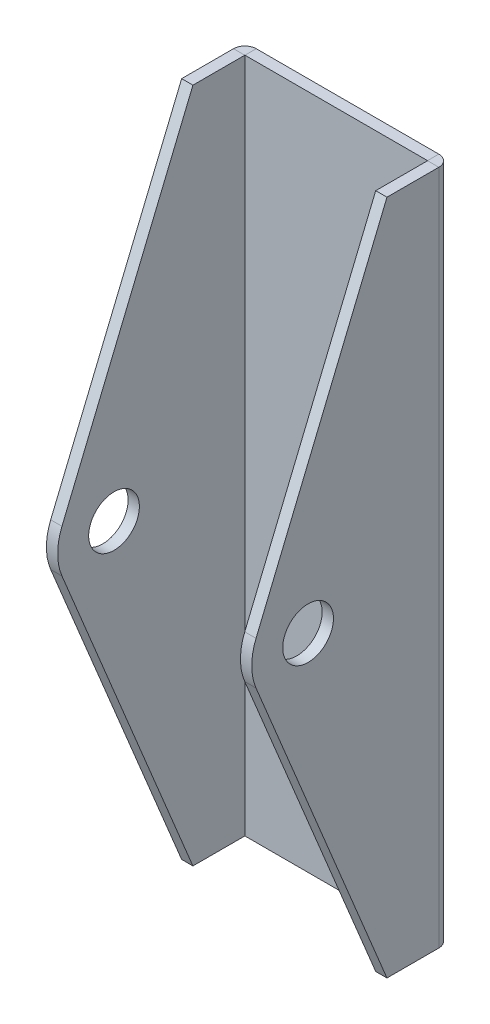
ISO-10303-21;
HEADER;
FILE_DESCRIPTION(('STEP AP214'),'2;1');
FILE_NAME('part.step','',(''),(''),'','','');
FILE_SCHEMA(('AUTOMOTIVE_DESIGN { 1 0 10303 214 1 1 1 1 }'));
ENDSEC;
DATA;
#1=APPLICATION_CONTEXT('core data for automotive mechanical design processes');
#2=APPLICATION_PROTOCOL_DEFINITION('international standard','automotive_design',2000,#1);
#3=PRODUCT_CONTEXT('',#1,'mechanical');
#4=PRODUCT('Part','Part','',(#3));
#5=PRODUCT_RELATED_PRODUCT_CATEGORY('part','',(#4));
#6=PRODUCT_DEFINITION_FORMATION('','',#4);
#7=PRODUCT_DEFINITION_CONTEXT('part definition',#1,'design');
#8=PRODUCT_DEFINITION('design','',#6,#7);
#9=PRODUCT_DEFINITION_SHAPE('','',#8);
#10=(LENGTH_UNIT() NAMED_UNIT(*) SI_UNIT(.MILLI.,.METRE.));
#11=(NAMED_UNIT(*) PLANE_ANGLE_UNIT() SI_UNIT($,.RADIAN.));
#12=(NAMED_UNIT(*) SI_UNIT($,.STERADIAN.) SOLID_ANGLE_UNIT());
#13=UNCERTAINTY_MEASURE_WITH_UNIT(LENGTH_MEASURE(1.E-05),#10,'distance_accuracy_value','');
#14=(GEOMETRIC_REPRESENTATION_CONTEXT(3) GLOBAL_UNCERTAINTY_ASSIGNED_CONTEXT((#13)) GLOBAL_UNIT_ASSIGNED_CONTEXT((#10,
#11,#12)) REPRESENTATION_CONTEXT('',''));
#15=CARTESIAN_POINT('',(0.,0.,0.));
#16=DIRECTION('',(0.,0.,1.));
#17=DIRECTION('',(1.,0.,0.));
#18=AXIS2_PLACEMENT_3D('',#15,#16,#17);
#19=CARTESIAN_POINT('',(-19.3993197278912,0.,1.));
#20=DIRECTION('',(0.,0.,1.));
#21=DIRECTION('',(1.,0.,0.));
#22=AXIS2_PLACEMENT_3D('',#19,#20,#21);
#23=PLANE('',#22);
#24=CARTESIAN_POINT('',(1.10068027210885,0.,1.));
#25=DIRECTION('',(0.,0.,1.));
#26=DIRECTION('',(1.,0.,0.));
#27=AXIS2_PLACEMENT_3D('',#24,#25,#26);
#28=CIRCLE('',#27,2.75);
#29=CARTESIAN_POINT('',(3.85068027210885,0.,1.));
#30=VERTEX_POINT('',#29);
#31=EDGE_CURVE('E280',#30,#30,#28,.T.);
#32=ORIENTED_EDGE('',*,*,#31,.F.);
#33=EDGE_LOOP('',(#32));
#34=FACE_BOUND('',#33,.T.);
#35=DIRECTION('',(1.,0.,0.));
#36=VECTOR('',#35,1.);
#37=CARTESIAN_POINT('',(-12.3998798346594,-30.0002317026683,1.));
#38=LINE('',#37,#36);
#39=CARTESIAN_POINT('',(-6.99876666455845,-30.0002317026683,0.999999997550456));
#40=VERTEX_POINT('',#39);
#41=CARTESIAN_POINT('',(9.20012720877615,-30.0002317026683,1.));
#42=VERTEX_POINT('',#41);
#43=EDGE_CURVE('E44',#40,#42,#38,.T.);
#44=ORIENTED_EDGE('',*,*,#43,.T.);
#45=DIRECTION('',(0.,1.,0.));
#46=VECTOR('',#45,1.);
#47=CARTESIAN_POINT('',(9.20012720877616,0.,1.));
#48=LINE('',#47,#46);
#49=CARTESIAN_POINT('',(9.20012720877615,30.0002317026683,0.999999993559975));
#50=VERTEX_POINT('',#49);
#51=EDGE_CURVE('E293',#42,#50,#48,.T.);
#52=ORIENTED_EDGE('',*,*,#51,.T.);
#53=DIRECTION('',(-1.,0.,0.));
#54=VECTOR('',#53,1.);
#55=CARTESIAN_POINT('',(-12.3998798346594,30.0002317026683,1.));
#56=LINE('',#55,#54);
#57=CARTESIAN_POINT('',(-6.99876666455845,30.0002317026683,0.999999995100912));
#58=VERTEX_POINT('',#57);
#59=EDGE_CURVE('E286',#50,#58,#56,.T.);
#60=ORIENTED_EDGE('',*,*,#59,.T.);
#61=DIRECTION('',(0.,1.,0.));
#62=VECTOR('',#61,1.);
#63=CARTESIAN_POINT('',(-6.99876666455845,0.,1.));
#64=LINE('',#63,#62);
#65=EDGE_CURVE('E283',#40,#58,#64,.T.);
#66=ORIENTED_EDGE('',*,*,#65,.F.);
#67=EDGE_LOOP('',(#44,#52,#60,#66));
#68=FACE_BOUND('',#67,.T.);
#69=ADVANCED_FACE('F40',(#34,#68),#23,.T.);
#70=CARTESIAN_POINT('',(-12.3998798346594,30.0002317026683,1.));
#71=DIRECTION('',(0.,-1.,0.));
#72=DIRECTION('',(1.,0.,0.));
#73=AXIS2_PLACEMENT_3D('',#70,#71,#72);
#74=PLANE('',#73);
#75=DIRECTION('',(0.,0.,1.));
#76=VECTOR('',#75,1.);
#77=CARTESIAN_POINT('',(9.20012720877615,30.0002317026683,1.));
#78=LINE('',#77,#76);
#79=CARTESIAN_POINT('',(9.20012720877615,30.0002317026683,0.));
#80=VERTEX_POINT('',#79);
#81=EDGE_CURVE('E12',#80,#50,#78,.T.);
#82=ORIENTED_EDGE('',*,*,#81,.F.);
#83=DIRECTION('',(-1.,0.,0.));
#84=VECTOR('',#83,1.);
#85=CARTESIAN_POINT('',(-12.3998798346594,30.0002317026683,0.));
#86=LINE('',#85,#84);
#87=CARTESIAN_POINT('',(-6.99876666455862,30.0002317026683,-4.89908807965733E-09));
#88=VERTEX_POINT('',#87);
#89=EDGE_CURVE('E57',#80,#88,#86,.T.);
#90=ORIENTED_EDGE('',*,*,#89,.T.);
#91=DIRECTION('',(0.,0.,1.));
#92=VECTOR('',#91,1.);
#93=CARTESIAN_POINT('',(-6.99876666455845,30.0002317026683,1.));
#94=LINE('',#93,#92);
#95=EDGE_CURVE('E285',#88,#58,#94,.T.);
#96=ORIENTED_EDGE('',*,*,#95,.T.);
#97=ORIENTED_EDGE('',*,*,#59,.F.);
#98=EDGE_LOOP('',(#82,#90,#96,#97));
#99=FACE_BOUND('',#98,.T.);
#100=ADVANCED_FACE('F42',(#99),#74,.F.);
#101=CARTESIAN_POINT('',(-12.3998798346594,-30.0002317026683,1.));
#102=DIRECTION('',(0.,1.,0.));
#103=DIRECTION('',(0.,0.,1.));
#104=AXIS2_PLACEMENT_3D('',#101,#102,#103);
#105=PLANE('',#104);
#106=DIRECTION('',(0.,0.,-1.));
#107=VECTOR('',#106,1.);
#108=CARTESIAN_POINT('',(9.20012720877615,-30.0002317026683,1.));
#109=LINE('',#108,#107);
#110=CARTESIAN_POINT('',(9.20012720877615,-30.0002317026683,0.));
#111=VERTEX_POINT('',#110);
#112=EDGE_CURVE('E296',#42,#111,#109,.T.);
#113=ORIENTED_EDGE('',*,*,#112,.F.);
#114=ORIENTED_EDGE('',*,*,#43,.F.);
#115=DIRECTION('',(0.,0.,-1.));
#116=VECTOR('',#115,1.);
#117=CARTESIAN_POINT('',(-6.99876666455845,-30.0002317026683,1.));
#118=LINE('',#117,#116);
#119=CARTESIAN_POINT('',(-6.99876666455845,-30.0002317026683,0.));
#120=VERTEX_POINT('',#119);
#121=EDGE_CURVE('E291',#40,#120,#118,.T.);
#122=ORIENTED_EDGE('',*,*,#121,.T.);
#123=DIRECTION('',(1.,0.,0.));
#124=VECTOR('',#123,1.);
#125=CARTESIAN_POINT('',(-12.3998798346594,-30.0002317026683,0.));
#126=LINE('',#125,#124);
#127=EDGE_CURVE('E65',#120,#111,#126,.T.);
#128=ORIENTED_EDGE('',*,*,#127,.T.);
#129=EDGE_LOOP('',(#113,#114,#122,#128));
#130=FACE_BOUND('',#129,.T.);
#131=ADVANCED_FACE('F307',(#130),#105,.F.);
#132=CARTESIAN_POINT('',(-19.3993197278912,0.,0.));
#133=DIRECTION('',(0.,0.,1.));
#134=DIRECTION('',(1.,0.,0.));
#135=AXIS2_PLACEMENT_3D('',#132,#133,#134);
#136=PLANE('',#135);
#137=DIRECTION('',(0.,1.,0.));
#138=VECTOR('',#137,1.);
#139=CARTESIAN_POINT('',(9.20012720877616,0.,0.));
#140=LINE('',#139,#138);
#141=EDGE_CURVE('E49',#111,#80,#140,.T.);
#142=ORIENTED_EDGE('',*,*,#141,.F.);
#143=ORIENTED_EDGE('',*,*,#127,.F.);
#144=DIRECTION('',(0.,1.,0.));
#145=VECTOR('',#144,1.);
#146=CARTESIAN_POINT('',(-6.99876666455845,0.,0.));
#147=LINE('',#146,#145);
#148=EDGE_CURVE('E289',#120,#88,#147,.T.);
#149=ORIENTED_EDGE('',*,*,#148,.T.);
#150=ORIENTED_EDGE('',*,*,#89,.F.);
#151=EDGE_LOOP('',(#142,#143,#149,#150));
#152=FACE_BOUND('',#151,.T.);
#153=CARTESIAN_POINT('',(1.10068027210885,0.,0.));
#154=DIRECTION('',(0.,0.,1.));
#155=DIRECTION('',(1.,0.,0.));
#156=AXIS2_PLACEMENT_3D('',#153,#154,#155);
#157=CIRCLE('',#156,2.75);
#158=CARTESIAN_POINT('',(3.85068027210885,0.,0.));
#159=VERTEX_POINT('',#158);
#160=EDGE_CURVE('E277',#159,#159,#157,.T.);
#161=ORIENTED_EDGE('',*,*,#160,.T.);
#162=EDGE_LOOP('',(#161));
#163=FACE_BOUND('',#162,.T.);
#164=ADVANCED_FACE('F337',(#152,#163),#136,.F.);
#165=CARTESIAN_POINT('',(1.10068027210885,0.,1.));
#166=DIRECTION('',(0.,0.,-1.));
#167=DIRECTION('',(-1.,0.,0.));
#168=AXIS2_PLACEMENT_3D('',#165,#166,#167);
#169=CYLINDRICAL_SURFACE('',#168,2.75);
#170=ORIENTED_EDGE('',*,*,#31,.T.);
#171=EDGE_LOOP('',(#170));
#172=FACE_BOUND('',#171,.T.);
#173=ORIENTED_EDGE('',*,*,#160,.F.);
#174=EDGE_LOOP('',(#173));
#175=FACE_BOUND('',#174,.T.);
#176=ADVANCED_FACE('F400',(#172,#175),#169,.F.);
#177=CARTESIAN_POINT('',(-6.99876666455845,-30.0002317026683,1.01000000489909));
#178=DIRECTION('',(0.,1.,0.));
#179=DIRECTION('',(0.,0.,1.));
#180=AXIS2_PLACEMENT_3D('',#177,#178,#179);
#181=PLANE('',#180);
#182=DIRECTION('',(-1.,0.,0.));
#183=VECTOR('',#182,1.);
#184=CARTESIAN_POINT('',(-7.00876666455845,-30.0002317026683,1.01));
#185=LINE('',#184,#183);
#186=CARTESIAN_POINT('',(-7.00876666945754,-30.0002317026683,1.01));
#187=VERTEX_POINT('',#186);
#188=CARTESIAN_POINT('',(-8.00876666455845,-30.0002317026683,1.01));
#189=VERTEX_POINT('',#188);
#190=EDGE_CURVE('E214',#187,#189,#185,.T.);
#191=ORIENTED_EDGE('',*,*,#190,.T.);
#192=CARTESIAN_POINT('',(-6.99876666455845,-30.0002317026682,1.01));
#193=DIRECTION('',(0.,-1.,0.));
#194=DIRECTION('',(0.,0.,-1.));
#195=AXIS2_PLACEMENT_3D('',#192,#193,#194);
#196=CIRCLE('',#195,1.01000000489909);
#197=EDGE_CURVE('E217',#189,#120,#196,.T.);
#198=ORIENTED_EDGE('',*,*,#197,.T.);
#199=ORIENTED_EDGE('',*,*,#121,.F.);
#200=CARTESIAN_POINT('',(-6.99876666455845,-30.0002317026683,1.01000000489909));
#201=DIRECTION('',(0.,-1.,0.));
#202=DIRECTION('',(0.,0.,-1.));
#203=AXIS2_PLACEMENT_3D('',#200,#201,#202);
#204=CIRCLE('',#203,0.0100000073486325);
#205=EDGE_CURVE('E271',#187,#40,#204,.T.);
#206=ORIENTED_EDGE('',*,*,#205,.F.);
#207=EDGE_LOOP('',(#191,#198,#199,#206));
#208=FACE_BOUND('',#207,.T.);
#209=ADVANCED_FACE('F342',(#208),#181,.F.);
#210=CARTESIAN_POINT('',(-6.99876666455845,30.0002317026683,1.01000000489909));
#211=DIRECTION('',(0.,-1.,0.));
#212=DIRECTION('',(0.,0.,-1.));
#213=AXIS2_PLACEMENT_3D('',#210,#211,#212);
#214=PLANE('',#213);
#215=CARTESIAN_POINT('',(-6.99876666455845,30.0002317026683,1.01));
#216=DIRECTION('',(0.,-1.,0.));
#217=DIRECTION('',(0.,0.,-1.));
#218=AXIS2_PLACEMENT_3D('',#215,#216,#217);
#219=CIRCLE('',#218,1.01000000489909);
#220=CARTESIAN_POINT('',(-8.00876666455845,30.0002317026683,1.01));
#221=VERTEX_POINT('',#220);
#222=EDGE_CURVE('E268',#88,#221,#219,.F.);
#223=ORIENTED_EDGE('',*,*,#222,.T.);
#224=DIRECTION('',(1.,0.,0.));
#225=VECTOR('',#224,1.);
#226=CARTESIAN_POINT('',(-7.00876666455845,30.0002317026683,1.01));
#227=LINE('',#226,#225);
#228=CARTESIAN_POINT('',(-7.00876666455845,30.0002317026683,1.01));
#229=VERTEX_POINT('',#228);
#230=EDGE_CURVE('E259',#221,#229,#227,.T.);
#231=ORIENTED_EDGE('',*,*,#230,.T.);
#232=CARTESIAN_POINT('',(-6.99876666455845,30.0002317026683,1.01000000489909));
#233=DIRECTION('',(0.,1.,0.));
#234=DIRECTION('',(0.,0.,1.));
#235=AXIS2_PLACEMENT_3D('',#232,#233,#234);
#236=CIRCLE('',#235,0.0100000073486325);
#237=EDGE_CURVE('E274',#58,#229,#236,.T.);
#238=ORIENTED_EDGE('',*,*,#237,.F.);
#239=ORIENTED_EDGE('',*,*,#95,.F.);
#240=EDGE_LOOP('',(#223,#231,#238,#239));
#241=FACE_BOUND('',#240,.T.);
#242=ADVANCED_FACE('F358',(#241),#214,.F.);
#243=CARTESIAN_POINT('',(-6.99876666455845,60.0141431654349,1.01));
#244=DIRECTION('',(0.,-1.,0.));
#245=DIRECTION('',(0.,0.,-1.));
#246=AXIS2_PLACEMENT_3D('',#243,#244,#245);
#247=CYLINDRICAL_SURFACE('',#246,0.010000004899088);
#248=ORIENTED_EDGE('',*,*,#65,.T.);
#249=ORIENTED_EDGE('',*,*,#237,.T.);
#250=DIRECTION('',(0.,1.,0.));
#251=VECTOR('',#250,1.);
#252=CARTESIAN_POINT('',(-7.00876666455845,0.,1.01));
#253=LINE('',#252,#251);
#254=EDGE_CURVE('E235',#187,#229,#253,.T.);
#255=ORIENTED_EDGE('',*,*,#254,.F.);
#256=ORIENTED_EDGE('',*,*,#205,.T.);
#257=EDGE_LOOP('',(#248,#249,#255,#256));
#258=FACE_BOUND('',#257,.T.);
#259=ADVANCED_FACE('F346',(#258),#247,.F.);
#260=CARTESIAN_POINT('',(-6.99876666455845,60.0141431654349,1.01));
#261=DIRECTION('',(0.,-1.,0.));
#262=DIRECTION('',(0.,0.,-1.));
#263=AXIS2_PLACEMENT_3D('',#260,#261,#262);
#264=CYLINDRICAL_SURFACE('',#263,1.01000000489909);
#265=ORIENTED_EDGE('',*,*,#148,.F.);
#266=ORIENTED_EDGE('',*,*,#197,.F.);
#267=DIRECTION('',(0.,1.,0.));
#268=VECTOR('',#267,1.);
#269=CARTESIAN_POINT('',(-8.00876666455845,0.,1.01));
#270=LINE('',#269,#268);
#271=EDGE_CURVE('E262',#189,#221,#270,.T.);
#272=ORIENTED_EDGE('',*,*,#271,.T.);
#273=ORIENTED_EDGE('',*,*,#222,.F.);
#274=EDGE_LOOP('',(#265,#266,#272,#273));
#275=FACE_BOUND('',#274,.T.);
#276=ADVANCED_FACE('F361',(#275),#264,.T.);
#277=CARTESIAN_POINT('',(-7.00876666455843,-30.0002317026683,5.61000704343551));
#278=DIRECTION('',(0.,0.382259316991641,-0.92405509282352));
#279=DIRECTION('',(0.,0.92405509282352,0.382259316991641));
#280=AXIS2_PLACEMENT_3D('',#277,#278,#279);
#281=PLANE('',#280);
#282=DIRECTION('',(0.,-0.92405509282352,-0.382259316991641));
#283=VECTOR('',#282,1.);
#284=CARTESIAN_POINT('',(-8.00876666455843,-30.0002317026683,5.61000704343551));
#285=LINE('',#284,#283);
#286=CARTESIAN_POINT('',(-8.0087666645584,-1.9112965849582,17.2297224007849));
#287=VERTEX_POINT('',#286);
#288=CARTESIAN_POINT('',(-8.00876666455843,-30.0002317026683,5.61000704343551));
#289=VERTEX_POINT('',#288);
#290=EDGE_CURVE('E257',#287,#289,#285,.T.);
#291=ORIENTED_EDGE('',*,*,#290,.T.);
#292=DIRECTION('',(-1.,0.,0.));
#293=VECTOR('',#292,1.);
#294=CARTESIAN_POINT('',(-7.00876666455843,-30.0002317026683,5.61000704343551));
#295=LINE('',#294,#293);
#296=CARTESIAN_POINT('',(-7.00876666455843,-30.0002317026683,5.61000704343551));
#297=VERTEX_POINT('',#296);
#298=EDGE_CURVE('E218',#297,#289,#295,.T.);
#299=ORIENTED_EDGE('',*,*,#298,.F.);
#300=DIRECTION('',(0.,-0.92405509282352,-0.382259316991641));
#301=VECTOR('',#300,1.);
#302=CARTESIAN_POINT('',(-7.00876666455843,-30.0002317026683,5.61000704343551));
#303=LINE('',#302,#301);
#304=CARTESIAN_POINT('',(-7.00876666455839,-1.9112965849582,17.2297224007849));
#305=VERTEX_POINT('',#304);
#306=EDGE_CURVE('E226',#305,#297,#303,.T.);
#307=ORIENTED_EDGE('',*,*,#306,.F.);
#308=DIRECTION('',(-1.,0.,0.));
#309=VECTOR('',#308,1.);
#310=CARTESIAN_POINT('',(-7.00876666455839,-1.9112965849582,17.2297224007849));
#311=LINE('',#310,#309);
#312=EDGE_CURVE('E254',#305,#287,#311,.T.);
#313=ORIENTED_EDGE('',*,*,#312,.T.);
#314=EDGE_LOOP('',(#291,#299,#307,#313));
#315=FACE_BOUND('',#314,.T.);
#316=ADVANCED_FACE('F374',(#315),#281,.F.);
#317=CARTESIAN_POINT('',(-7.00876666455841,0.,12.6094469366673));
#318=DIRECTION('',(-1.,0.,0.));
#319=DIRECTION('',(0.,0.,1.));
#320=AXIS2_PLACEMENT_3D('',#317,#318,#319);
#321=CYLINDRICAL_SURFACE('',#320,5.);
#322=CARTESIAN_POINT('',(-8.00876666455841,0.,12.6094469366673));
#323=DIRECTION('',(1.,0.,0.));
#324=DIRECTION('',(0.,0.,-1.));
#325=AXIS2_PLACEMENT_3D('',#322,#323,#324);
#326=CIRCLE('',#325,5.);
#327=CARTESIAN_POINT('',(-8.0087666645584,1.9112965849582,17.2297224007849));
#328=VERTEX_POINT('',#327);
#329=EDGE_CURVE('E252',#328,#287,#326,.T.);
#330=ORIENTED_EDGE('',*,*,#329,.T.);
#331=ORIENTED_EDGE('',*,*,#312,.F.);
#332=CARTESIAN_POINT('',(-7.00876666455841,0.,12.6094469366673));
#333=DIRECTION('',(1.,0.,0.));
#334=DIRECTION('',(0.,0.,-1.));
#335=AXIS2_PLACEMENT_3D('',#332,#333,#334);
#336=CIRCLE('',#335,5.);
#337=CARTESIAN_POINT('',(-7.00876666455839,1.9112965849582,17.2297224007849));
#338=VERTEX_POINT('',#337);
#339=EDGE_CURVE('E228',#338,#305,#336,.T.);
#340=ORIENTED_EDGE('',*,*,#339,.F.);
#341=DIRECTION('',(-1.,0.,0.));
#342=VECTOR('',#341,1.);
#343=CARTESIAN_POINT('',(-7.00876666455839,1.9112965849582,17.2297224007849));
#344=LINE('',#343,#342);
#345=EDGE_CURVE('E249',#338,#328,#344,.T.);
#346=ORIENTED_EDGE('',*,*,#345,.T.);
#347=EDGE_LOOP('',(#330,#331,#340,#346));
#348=FACE_BOUND('',#347,.T.);
#349=ADVANCED_FACE('F378',(#348),#321,.T.);
#350=CARTESIAN_POINT('',(-7.00876666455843,30.0002317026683,5.61000704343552));
#351=DIRECTION('',(0.,-0.382259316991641,-0.92405509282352));
#352=DIRECTION('',(0.,0.92405509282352,-0.382259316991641));
#353=AXIS2_PLACEMENT_3D('',#350,#351,#352);
#354=PLANE('',#353);
#355=DIRECTION('',(0.,-0.92405509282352,0.382259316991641));
#356=VECTOR('',#355,1.);
#357=CARTESIAN_POINT('',(-8.00876666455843,30.0002317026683,5.61000704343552));
#358=LINE('',#357,#356);
#359=CARTESIAN_POINT('',(-8.00876666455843,30.0002317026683,5.61000704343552));
#360=VERTEX_POINT('',#359);
#361=EDGE_CURVE('E246',#360,#328,#358,.T.);
#362=ORIENTED_EDGE('',*,*,#361,.T.);
#363=ORIENTED_EDGE('',*,*,#345,.F.);
#364=DIRECTION('',(0.,-0.92405509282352,0.382259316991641));
#365=VECTOR('',#364,1.);
#366=CARTESIAN_POINT('',(-7.00876666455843,30.0002317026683,5.61000704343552));
#367=LINE('',#366,#365);
#368=CARTESIAN_POINT('',(-7.00876666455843,30.0002317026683,5.61000704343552));
#369=VERTEX_POINT('',#368);
#370=EDGE_CURVE('E230',#369,#338,#367,.T.);
#371=ORIENTED_EDGE('',*,*,#370,.F.);
#372=DIRECTION('',(-1.,0.,0.));
#373=VECTOR('',#372,1.);
#374=CARTESIAN_POINT('',(-7.00876666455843,30.0002317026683,5.61000704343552));
#375=LINE('',#374,#373);
#376=EDGE_CURVE('E243',#369,#360,#375,.T.);
#377=ORIENTED_EDGE('',*,*,#376,.T.);
#378=EDGE_LOOP('',(#362,#363,#371,#377));
#379=FACE_BOUND('',#378,.T.);
#380=ADVANCED_FACE('F380',(#379),#354,.F.);
#381=CARTESIAN_POINT('',(-7.00876666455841,0.,12.6094469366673));
#382=DIRECTION('',(-1.,0.,0.));
#383=DIRECTION('',(0.,0.,1.));
#384=AXIS2_PLACEMENT_3D('',#381,#382,#383);
#385=CYLINDRICAL_SURFACE('',#384,2.25);
#386=CARTESIAN_POINT('',(-7.00876666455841,0.,12.6094469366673));
#387=DIRECTION('',(1.,0.,0.));
#388=DIRECTION('',(0.,0.,-1.));
#389=AXIS2_PLACEMENT_3D('',#386,#387,#388);
#390=CIRCLE('',#389,2.25);
#391=CARTESIAN_POINT('',(-7.00876666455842,0.,10.3594469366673));
#392=VERTEX_POINT('',#391);
#393=EDGE_CURVE('E240',#392,#392,#390,.T.);
#394=ORIENTED_EDGE('',*,*,#393,.T.);
#395=EDGE_LOOP('',(#394));
#396=FACE_BOUND('',#395,.T.);
#397=CARTESIAN_POINT('',(-8.00876666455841,0.,12.6094469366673));
#398=DIRECTION('',(1.,0.,0.));
#399=DIRECTION('',(0.,0.,-1.));
#400=AXIS2_PLACEMENT_3D('',#397,#398,#399);
#401=CIRCLE('',#400,2.25);
#402=CARTESIAN_POINT('',(-8.00876666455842,0.,10.3594469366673));
#403=VERTEX_POINT('',#402);
#404=EDGE_CURVE('E221',#403,#403,#401,.T.);
#405=ORIENTED_EDGE('',*,*,#404,.F.);
#406=EDGE_LOOP('',(#405));
#407=FACE_BOUND('',#406,.T.);
#408=ADVANCED_FACE('F382',(#396,#407),#385,.F.);
#409=CARTESIAN_POINT('',(-7.00876666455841,0.,12.6094469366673));
#410=DIRECTION('',(1.,0.,0.));
#411=DIRECTION('',(0.,0.,-1.));
#412=AXIS2_PLACEMENT_3D('',#409,#410,#411);
#413=PLANE('',#412);
#414=ORIENTED_EDGE('',*,*,#393,.F.);
#415=EDGE_LOOP('',(#414));
#416=FACE_BOUND('',#415,.T.);
#417=DIRECTION('',(0.,0.,-1.));
#418=VECTOR('',#417,1.);
#419=CARTESIAN_POINT('',(-7.00876666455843,-30.0002317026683,5.61000704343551));
#420=LINE('',#419,#418);
#421=EDGE_CURVE('E237',#297,#187,#420,.T.);
#422=ORIENTED_EDGE('',*,*,#421,.T.);
#423=ORIENTED_EDGE('',*,*,#254,.T.);
#424=DIRECTION('',(0.,0.,1.));
#425=VECTOR('',#424,1.);
#426=CARTESIAN_POINT('',(-7.00876666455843,30.0002317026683,5.61000704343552));
#427=LINE('',#426,#425);
#428=EDGE_CURVE('E233',#229,#369,#427,.T.);
#429=ORIENTED_EDGE('',*,*,#428,.T.);
#430=ORIENTED_EDGE('',*,*,#370,.T.);
#431=ORIENTED_EDGE('',*,*,#339,.T.);
#432=ORIENTED_EDGE('',*,*,#306,.T.);
#433=EDGE_LOOP('',(#422,#423,#429,#430,#431,#432));
#434=FACE_BOUND('',#433,.T.);
#435=ADVANCED_FACE('F350',(#416,#434),#413,.T.);
#436=CARTESIAN_POINT('',(-7.00876666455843,30.0002317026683,5.61000704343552));
#437=DIRECTION('',(0.,-1.,0.));
#438=DIRECTION('',(0.,0.,-1.));
#439=AXIS2_PLACEMENT_3D('',#436,#437,#438);
#440=PLANE('',#439);
#441=ORIENTED_EDGE('',*,*,#230,.F.);
#442=DIRECTION('',(0.,0.,1.));
#443=VECTOR('',#442,1.);
#444=CARTESIAN_POINT('',(-8.00876666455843,30.0002317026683,5.61000704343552));
#445=LINE('',#444,#443);
#446=EDGE_CURVE('E224',#221,#360,#445,.T.);
#447=ORIENTED_EDGE('',*,*,#446,.T.);
#448=ORIENTED_EDGE('',*,*,#376,.F.);
#449=ORIENTED_EDGE('',*,*,#428,.F.);
#450=EDGE_LOOP('',(#441,#447,#448,#449));
#451=FACE_BOUND('',#450,.T.);
#452=ADVANCED_FACE('F355',(#451),#440,.F.);
#453=CARTESIAN_POINT('',(-8.00876666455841,0.,12.6094469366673));
#454=DIRECTION('',(1.,0.,0.));
#455=DIRECTION('',(0.,0.,-1.));
#456=AXIS2_PLACEMENT_3D('',#453,#454,#455);
#457=PLANE('',#456);
#458=ORIENTED_EDGE('',*,*,#271,.F.);
#459=DIRECTION('',(0.,0.,-1.));
#460=VECTOR('',#459,1.);
#461=CARTESIAN_POINT('',(-8.00876666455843,-30.0002317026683,5.61000704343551));
#462=LINE('',#461,#460);
#463=EDGE_CURVE('E215',#289,#189,#462,.T.);
#464=ORIENTED_EDGE('',*,*,#463,.F.);
#465=ORIENTED_EDGE('',*,*,#290,.F.);
#466=ORIENTED_EDGE('',*,*,#329,.F.);
#467=ORIENTED_EDGE('',*,*,#361,.F.);
#468=ORIENTED_EDGE('',*,*,#446,.F.);
#469=EDGE_LOOP('',(#458,#464,#465,#466,#467,#468));
#470=FACE_BOUND('',#469,.T.);
#471=ORIENTED_EDGE('',*,*,#404,.T.);
#472=EDGE_LOOP('',(#471));
#473=FACE_BOUND('',#472,.T.);
#474=ADVANCED_FACE('F365',(#470,#473),#457,.F.);
#475=CARTESIAN_POINT('',(-7.00876666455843,-30.0002317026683,5.61000704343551));
#476=DIRECTION('',(0.,1.,0.));
#477=DIRECTION('',(1.,0.,0.));
#478=AXIS2_PLACEMENT_3D('',#475,#476,#477);
#479=PLANE('',#478);
#480=ORIENTED_EDGE('',*,*,#190,.F.);
#481=ORIENTED_EDGE('',*,*,#421,.F.);
#482=ORIENTED_EDGE('',*,*,#298,.T.);
#483=ORIENTED_EDGE('',*,*,#463,.T.);
#484=EDGE_LOOP('',(#480,#481,#482,#483));
#485=FACE_BOUND('',#484,.T.);
#486=ADVANCED_FACE('F370',(#485),#479,.F.);
#487=CARTESIAN_POINT('',(9.20012720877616,-30.0002317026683,1.01000000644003));
#488=DIRECTION('',(0.,1.,0.));
#489=DIRECTION('',(0.,0.,1.));
#490=AXIS2_PLACEMENT_3D('',#487,#488,#489);
#491=PLANE('',#490);
#492=ORIENTED_EDGE('',*,*,#112,.T.);
#493=CARTESIAN_POINT('',(9.20012720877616,-30.0002317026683,1.01));
#494=DIRECTION('',(0.,1.,0.));
#495=DIRECTION('',(0.,0.,1.));
#496=AXIS2_PLACEMENT_3D('',#493,#494,#495);
#497=CIRCLE('',#496,1.01000000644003);
#498=CARTESIAN_POINT('',(10.2101272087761,-30.0002317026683,1.01));
#499=VERTEX_POINT('',#498);
#500=EDGE_CURVE('E201',#111,#499,#497,.F.);
#501=ORIENTED_EDGE('',*,*,#500,.T.);
#502=DIRECTION('',(1.,0.,0.));
#503=VECTOR('',#502,1.);
#504=CARTESIAN_POINT('',(9.21012720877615,-30.0002317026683,1.01000000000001));
#505=LINE('',#504,#503);
#506=CARTESIAN_POINT('',(9.21012720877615,-30.0002317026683,1.01));
#507=VERTEX_POINT('',#506);
#508=EDGE_CURVE('E165',#507,#499,#505,.T.);
#509=ORIENTED_EDGE('',*,*,#508,.F.);
#510=CARTESIAN_POINT('',(9.20012720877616,-30.0002317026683,1.01000000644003));
#511=DIRECTION('',(0.,-1.,0.));
#512=DIRECTION('',(0.,0.,-1.));
#513=AXIS2_PLACEMENT_3D('',#510,#511,#512);
#514=CIRCLE('',#513,0.0100000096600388);
#515=EDGE_CURVE('E208',#42,#507,#514,.T.);
#516=ORIENTED_EDGE('',*,*,#515,.F.);
#517=EDGE_LOOP('',(#492,#501,#509,#516));
#518=FACE_BOUND('',#517,.T.);
#519=ADVANCED_FACE('F314',(#518),#491,.F.);
#520=CARTESIAN_POINT('',(9.20012720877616,30.0002317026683,1.01000000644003));
#521=DIRECTION('',(0.,-1.,0.));
#522=DIRECTION('',(0.,0.,-1.));
#523=AXIS2_PLACEMENT_3D('',#520,#521,#522);
#524=PLANE('',#523);
#525=CARTESIAN_POINT('',(9.20012720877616,30.0002317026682,1.01));
#526=DIRECTION('',(0.,1.,0.));
#527=DIRECTION('',(0.,0.,1.));
#528=AXIS2_PLACEMENT_3D('',#525,#526,#527);
#529=CIRCLE('',#528,1.01000000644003);
#530=CARTESIAN_POINT('',(10.2101272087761,30.0002317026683,1.01));
#531=VERTEX_POINT('',#530);
#532=EDGE_CURVE('E204',#531,#80,#529,.T.);
#533=ORIENTED_EDGE('',*,*,#532,.T.);
#534=ORIENTED_EDGE('',*,*,#81,.T.);
#535=CARTESIAN_POINT('',(9.20012720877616,30.0002317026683,1.01000000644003));
#536=DIRECTION('',(0.,1.,0.));
#537=DIRECTION('',(0.,0.,1.));
#538=AXIS2_PLACEMENT_3D('',#535,#536,#537);
#539=CIRCLE('',#538,0.0100000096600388);
#540=CARTESIAN_POINT('',(9.21012721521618,30.0002317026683,1.01));
#541=VERTEX_POINT('',#540);
#542=EDGE_CURVE('E211',#541,#50,#539,.T.);
#543=ORIENTED_EDGE('',*,*,#542,.F.);
#544=DIRECTION('',(-1.,0.,0.));
#545=VECTOR('',#544,1.);
#546=CARTESIAN_POINT('',(9.21012720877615,30.0002317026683,1.01000000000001));
#547=LINE('',#546,#545);
#548=EDGE_CURVE('E332',#531,#541,#547,.T.);
#549=ORIENTED_EDGE('',*,*,#548,.F.);
#550=EDGE_LOOP('',(#533,#534,#543,#549));
#551=FACE_BOUND('',#550,.T.);
#552=ADVANCED_FACE('F331',(#551),#524,.F.);
#553=CARTESIAN_POINT('',(9.20012720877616,-60.0141431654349,1.01));
#554=DIRECTION('',(0.,1.,0.));
#555=DIRECTION('',(0.,0.,1.));
#556=AXIS2_PLACEMENT_3D('',#553,#554,#555);
#557=CYLINDRICAL_SURFACE('',#556,0.0100000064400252);
#558=DIRECTION('',(0.,1.,0.));
#559=VECTOR('',#558,1.);
#560=CARTESIAN_POINT('',(9.21012720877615,0.,1.01000000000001));
#561=LINE('',#560,#559);
#562=EDGE_CURVE('E198',#507,#541,#561,.T.);
#563=ORIENTED_EDGE('',*,*,#562,.T.);
#564=ORIENTED_EDGE('',*,*,#542,.T.);
#565=ORIENTED_EDGE('',*,*,#51,.F.);
#566=ORIENTED_EDGE('',*,*,#515,.T.);
#567=EDGE_LOOP('',(#563,#564,#565,#566));
#568=FACE_BOUND('',#567,.T.);
#569=ADVANCED_FACE('F312',(#568),#557,.F.);
#570=CARTESIAN_POINT('',(9.20012720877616,-60.0141431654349,1.01));
#571=DIRECTION('',(0.,1.,0.));
#572=DIRECTION('',(0.,0.,1.));
#573=AXIS2_PLACEMENT_3D('',#570,#571,#572);
#574=CYLINDRICAL_SURFACE('',#573,1.01000000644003);
#575=DIRECTION('',(0.,1.,0.));
#576=VECTOR('',#575,1.);
#577=CARTESIAN_POINT('',(10.2101272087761,0.,1.01000000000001));
#578=LINE('',#577,#576);
#579=EDGE_CURVE('E694',#499,#531,#578,.T.);
#580=ORIENTED_EDGE('',*,*,#579,.F.);
#581=ORIENTED_EDGE('',*,*,#500,.F.);
#582=ORIENTED_EDGE('',*,*,#141,.T.);
#583=ORIENTED_EDGE('',*,*,#532,.F.);
#584=EDGE_LOOP('',(#580,#581,#582,#583));
#585=FACE_BOUND('',#584,.T.);
#586=ADVANCED_FACE('F336',(#585),#574,.T.);
#587=CARTESIAN_POINT('',(9.21012720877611,0.,12.6094469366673));
#588=DIRECTION('',(1.,0.,0.));
#589=DIRECTION('',(0.,0.,-1.));
#590=AXIS2_PLACEMENT_3D('',#587,#588,#589);
#591=CYLINDRICAL_SURFACE('',#590,2.25);
#592=CARTESIAN_POINT('',(9.21012720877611,0.,12.6094469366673));
#593=DIRECTION('',(-1.,0.,0.));
#594=DIRECTION('',(0.,0.,-1.));
#595=AXIS2_PLACEMENT_3D('',#592,#593,#594);
#596=CIRCLE('',#595,2.25);
#597=CARTESIAN_POINT('',(9.21012720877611,0.,10.3594469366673));
#598=VERTEX_POINT('',#597);
#599=EDGE_CURVE('E195',#598,#598,#596,.T.);
#600=ORIENTED_EDGE('',*,*,#599,.T.);
#601=EDGE_LOOP('',(#600));
#602=FACE_BOUND('',#601,.T.);
#603=CARTESIAN_POINT('',(10.2101272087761,0.,12.6094469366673));
#604=DIRECTION('',(-1.,0.,0.));
#605=DIRECTION('',(0.,0.,-1.));
#606=AXIS2_PLACEMENT_3D('',#603,#604,#605);
#607=CIRCLE('',#606,2.25);
#608=CARTESIAN_POINT('',(10.2101272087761,0.,10.3594469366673));
#609=VERTEX_POINT('',#608);
#610=EDGE_CURVE('E170',#609,#609,#607,.T.);
#611=ORIENTED_EDGE('',*,*,#610,.F.);
#612=EDGE_LOOP('',(#611));
#613=FACE_BOUND('',#612,.T.);
#614=ADVANCED_FACE('F475',(#602,#613),#591,.F.);
#615=CARTESIAN_POINT('',(9.21012720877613,30.0002317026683,5.61000704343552));
#616=DIRECTION('',(0.,-0.382259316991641,-0.92405509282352));
#617=DIRECTION('',(0.,-0.92405509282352,0.382259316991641));
#618=AXIS2_PLACEMENT_3D('',#615,#616,#617);
#619=PLANE('',#618);
#620=DIRECTION('',(0.,0.92405509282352,-0.382259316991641));
#621=VECTOR('',#620,1.);
#622=CARTESIAN_POINT('',(10.2101272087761,30.0002317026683,5.61000704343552));
#623=LINE('',#622,#621);
#624=CARTESIAN_POINT('',(10.2101272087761,1.91129658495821,17.2297224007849));
#625=VERTEX_POINT('',#624);
#626=CARTESIAN_POINT('',(10.2101272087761,30.0002317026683,5.61000704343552));
#627=VERTEX_POINT('',#626);
#628=EDGE_CURVE('E193',#625,#627,#623,.T.);
#629=ORIENTED_EDGE('',*,*,#628,.T.);
#630=DIRECTION('',(1.,0.,0.));
#631=VECTOR('',#630,1.);
#632=CARTESIAN_POINT('',(9.21012720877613,30.0002317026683,5.61000704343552));
#633=LINE('',#632,#631);
#634=CARTESIAN_POINT('',(9.21012720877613,30.0002317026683,5.61000704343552));
#635=VERTEX_POINT('',#634);
#636=EDGE_CURVE('E205',#635,#627,#633,.T.);
#637=ORIENTED_EDGE('',*,*,#636,.F.);
#638=DIRECTION('',(0.,0.92405509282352,-0.382259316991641));
#639=VECTOR('',#638,1.);
#640=CARTESIAN_POINT('',(9.21012720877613,30.0002317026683,5.61000704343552));
#641=LINE('',#640,#639);
#642=CARTESIAN_POINT('',(9.21012720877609,1.91129658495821,17.2297224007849));
#643=VERTEX_POINT('',#642);
#644=EDGE_CURVE('E318',#643,#635,#641,.T.);
#645=ORIENTED_EDGE('',*,*,#644,.F.);
#646=DIRECTION('',(1.,0.,0.));
#647=VECTOR('',#646,1.);
#648=CARTESIAN_POINT('',(9.21012720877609,1.91129658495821,17.2297224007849));
#649=LINE('',#648,#647);
#650=EDGE_CURVE('E190',#643,#625,#649,.T.);
#651=ORIENTED_EDGE('',*,*,#650,.T.);
#652=EDGE_LOOP('',(#629,#637,#645,#651));
#653=FACE_BOUND('',#652,.T.);
#654=ADVANCED_FACE('F482',(#653),#619,.F.);
#655=CARTESIAN_POINT('',(9.21012720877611,0.,12.6094469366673));
#656=DIRECTION('',(1.,0.,0.));
#657=DIRECTION('',(0.,0.,-1.));
#658=AXIS2_PLACEMENT_3D('',#655,#656,#657);
#659=CYLINDRICAL_SURFACE('',#658,5.);
#660=CARTESIAN_POINT('',(10.2101272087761,0.,12.6094469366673));
#661=DIRECTION('',(-1.,0.,0.));
#662=DIRECTION('',(0.,0.,-1.));
#663=AXIS2_PLACEMENT_3D('',#660,#661,#662);
#664=CIRCLE('',#663,5.);
#665=CARTESIAN_POINT('',(10.2101272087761,-1.9112965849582,17.2297224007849));
#666=VERTEX_POINT('',#665);
#667=EDGE_CURVE('E183',#666,#625,#664,.T.);
#668=ORIENTED_EDGE('',*,*,#667,.T.);
#669=ORIENTED_EDGE('',*,*,#650,.F.);
#670=CARTESIAN_POINT('',(9.21012720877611,0.,12.6094469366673));
#671=DIRECTION('',(-1.,0.,0.));
#672=DIRECTION('',(0.,0.,-1.));
#673=AXIS2_PLACEMENT_3D('',#670,#671,#672);
#674=CIRCLE('',#673,5.);
#675=CARTESIAN_POINT('',(9.21012720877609,-1.9112965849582,17.2297224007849));
#676=VERTEX_POINT('',#675);
#677=EDGE_CURVE('E323',#676,#643,#674,.T.);
#678=ORIENTED_EDGE('',*,*,#677,.F.);
#679=DIRECTION('',(1.,0.,0.));
#680=VECTOR('',#679,1.);
#681=CARTESIAN_POINT('',(9.21012720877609,-1.9112965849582,17.2297224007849));
#682=LINE('',#681,#680);
#683=EDGE_CURVE('E184',#676,#666,#682,.T.);
#684=ORIENTED_EDGE('',*,*,#683,.T.);
#685=EDGE_LOOP('',(#668,#669,#678,#684));
#686=FACE_BOUND('',#685,.T.);
#687=ADVANCED_FACE('F490',(#686),#659,.T.);
#688=CARTESIAN_POINT('',(9.21012720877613,-30.0002317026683,5.61000704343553));
#689=DIRECTION('',(0.,0.382259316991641,-0.92405509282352));
#690=DIRECTION('',(0.,-0.92405509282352,-0.382259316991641));
#691=AXIS2_PLACEMENT_3D('',#688,#689,#690);
#692=PLANE('',#691);
#693=DIRECTION('',(0.,0.92405509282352,0.382259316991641));
#694=VECTOR('',#693,1.);
#695=CARTESIAN_POINT('',(10.2101272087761,-30.0002317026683,5.61000704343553));
#696=LINE('',#695,#694);
#697=CARTESIAN_POINT('',(10.2101272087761,-30.0002317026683,5.61000704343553));
#698=VERTEX_POINT('',#697);
#699=EDGE_CURVE('E175',#698,#666,#696,.T.);
#700=ORIENTED_EDGE('',*,*,#699,.T.);
#701=ORIENTED_EDGE('',*,*,#683,.F.);
#702=DIRECTION('',(0.,0.92405509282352,0.382259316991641));
#703=VECTOR('',#702,1.);
#704=CARTESIAN_POINT('',(9.21012720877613,-30.0002317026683,5.61000704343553));
#705=LINE('',#704,#703);
#706=CARTESIAN_POINT('',(9.21012720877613,-30.0002317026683,5.61000704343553));
#707=VERTEX_POINT('',#706);
#708=EDGE_CURVE('E177',#707,#676,#705,.T.);
#709=ORIENTED_EDGE('',*,*,#708,.F.);
#710=DIRECTION('',(1.,0.,0.));
#711=VECTOR('',#710,1.);
#712=CARTESIAN_POINT('',(9.21012720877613,-30.0002317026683,5.61000704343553));
#713=LINE('',#712,#711);
#714=EDGE_CURVE('E162',#707,#698,#713,.T.);
#715=ORIENTED_EDGE('',*,*,#714,.T.);
#716=EDGE_LOOP('',(#700,#701,#709,#715));
#717=FACE_BOUND('',#716,.T.);
#718=ADVANCED_FACE('F173',(#717),#692,.F.);
#719=CARTESIAN_POINT('',(9.21012720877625,0.,-28.3905530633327));
#720=DIRECTION('',(-1.,0.,0.));
#721=DIRECTION('',(0.,0.,1.));
#722=AXIS2_PLACEMENT_3D('',#719,#720,#721);
#723=PLANE('',#722);
#724=ORIENTED_EDGE('',*,*,#562,.F.);
#725=DIRECTION('',(0.,0.,1.));
#726=VECTOR('',#725,1.);
#727=CARTESIAN_POINT('',(9.21012720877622,-30.0002317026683,-21.3911131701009));
#728=LINE('',#727,#726);
#729=EDGE_CURVE('E178',#507,#707,#728,.T.);
#730=ORIENTED_EDGE('',*,*,#729,.T.);
#731=ORIENTED_EDGE('',*,*,#708,.T.);
#732=ORIENTED_EDGE('',*,*,#677,.T.);
#733=ORIENTED_EDGE('',*,*,#644,.T.);
#734=DIRECTION('',(0.,0.,-1.));
#735=VECTOR('',#734,1.);
#736=CARTESIAN_POINT('',(9.21012720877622,30.0002317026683,-21.3911131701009));
#737=LINE('',#736,#735);
#738=EDGE_CURVE('E315',#635,#541,#737,.T.);
#739=ORIENTED_EDGE('',*,*,#738,.T.);
#740=EDGE_LOOP('',(#724,#730,#731,#732,#733,#739));
#741=FACE_BOUND('',#740,.T.);
#742=ORIENTED_EDGE('',*,*,#599,.F.);
#743=EDGE_LOOP('',(#742));
#744=FACE_BOUND('',#743,.T.);
#745=ADVANCED_FACE('F326',(#741,#744),#723,.T.);
#746=CARTESIAN_POINT('',(9.21012720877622,-30.0002317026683,-21.3911131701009));
#747=DIRECTION('',(0.,1.,0.));
#748=DIRECTION('',(-1.,0.,0.));
#749=AXIS2_PLACEMENT_3D('',#746,#747,#748);
#750=PLANE('',#749);
#751=ORIENTED_EDGE('',*,*,#729,.F.);
#752=ORIENTED_EDGE('',*,*,#508,.T.);
#753=DIRECTION('',(0.,0.,1.));
#754=VECTOR('',#753,1.);
#755=CARTESIAN_POINT('',(10.2101272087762,-30.0002317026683,-21.3911131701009));
#756=LINE('',#755,#754);
#757=EDGE_CURVE('E158',#499,#698,#756,.T.);
#758=ORIENTED_EDGE('',*,*,#757,.T.);
#759=ORIENTED_EDGE('',*,*,#714,.F.);
#760=EDGE_LOOP('',(#751,#752,#758,#759));
#761=FACE_BOUND('',#760,.T.);
#762=ADVANCED_FACE('F161',(#761),#750,.F.);
#763=CARTESIAN_POINT('',(10.2101272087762,0.,-28.3905530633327));
#764=DIRECTION('',(-1.,0.,0.));
#765=DIRECTION('',(0.,0.,1.));
#766=AXIS2_PLACEMENT_3D('',#763,#764,#765);
#767=PLANE('',#766);
#768=ORIENTED_EDGE('',*,*,#610,.T.);
#769=EDGE_LOOP('',(#768));
#770=FACE_BOUND('',#769,.T.);
#771=ORIENTED_EDGE('',*,*,#757,.F.);
#772=ORIENTED_EDGE('',*,*,#579,.T.);
#773=DIRECTION('',(0.,0.,-1.));
#774=VECTOR('',#773,1.);
#775=CARTESIAN_POINT('',(10.2101272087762,30.0002317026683,-21.3911131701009));
#776=LINE('',#775,#774);
#777=EDGE_CURVE('E692',#627,#531,#776,.T.);
#778=ORIENTED_EDGE('',*,*,#777,.F.);
#779=ORIENTED_EDGE('',*,*,#628,.F.);
#780=ORIENTED_EDGE('',*,*,#667,.F.);
#781=ORIENTED_EDGE('',*,*,#699,.F.);
#782=EDGE_LOOP('',(#771,#772,#778,#779,#780,#781));
#783=FACE_BOUND('',#782,.T.);
#784=ADVANCED_FACE('F181',(#770,#783),#767,.F.);
#785=CARTESIAN_POINT('',(9.21012720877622,30.0002317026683,-21.3911131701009));
#786=DIRECTION('',(0.,-1.,0.));
#787=DIRECTION('',(0.,0.,1.));
#788=AXIS2_PLACEMENT_3D('',#785,#786,#787);
#789=PLANE('',#788);
#790=ORIENTED_EDGE('',*,*,#777,.T.);
#791=ORIENTED_EDGE('',*,*,#548,.T.);
#792=ORIENTED_EDGE('',*,*,#738,.F.);
#793=ORIENTED_EDGE('',*,*,#636,.T.);
#794=EDGE_LOOP('',(#790,#791,#792,#793));
#795=FACE_BOUND('',#794,.T.);
#796=ADVANCED_FACE('F523',(#795),#789,.F.);
#797=CLOSED_SHELL('',(#69,#100,#131,#164,#176,#209,#242,#259,#276,#316,#349,#380,#408,#435,#452,
#474,#486,#519,#552,#569,#586,#614,#654,#687,#718,#745,#762,#784,#796));
#798=MANIFOLD_SOLID_BREP('B2',#797);
#799=ADVANCED_BREP_SHAPE_REPRESENTATION('',(#18,#798),#14);
#800=SHAPE_DEFINITION_REPRESENTATION(#9,#799);
ENDSEC;
END-ISO-10303-21;
